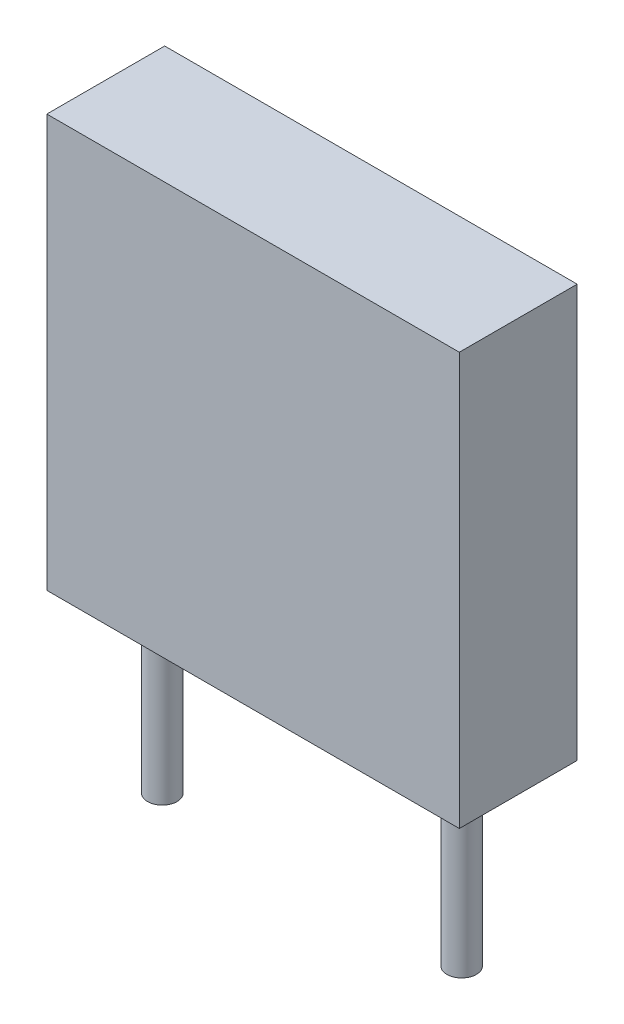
ISO-10303-21;
HEADER;
FILE_DESCRIPTION(('STEP AP214'),'2;1');
FILE_NAME('part.step','',(''),(''),'','','');
FILE_SCHEMA(('AUTOMOTIVE_DESIGN { 1 0 10303 214 1 1 1 1 }'));
ENDSEC;
DATA;
#1=APPLICATION_CONTEXT('core data for automotive mechanical design processes');
#2=APPLICATION_PROTOCOL_DEFINITION('international standard','automotive_design',2000,#1);
#3=PRODUCT_CONTEXT('',#1,'mechanical');
#4=PRODUCT('Part','Part','',(#3));
#5=PRODUCT_RELATED_PRODUCT_CATEGORY('part','',(#4));
#6=PRODUCT_DEFINITION_FORMATION('','',#4);
#7=PRODUCT_DEFINITION_CONTEXT('part definition',#1,'design');
#8=PRODUCT_DEFINITION('design','',#6,#7);
#9=PRODUCT_DEFINITION_SHAPE('','',#8);
#10=(LENGTH_UNIT() NAMED_UNIT(*) SI_UNIT(.MILLI.,.METRE.));
#11=(NAMED_UNIT(*) PLANE_ANGLE_UNIT() SI_UNIT($,.RADIAN.));
#12=(NAMED_UNIT(*) SI_UNIT($,.STERADIAN.) SOLID_ANGLE_UNIT());
#13=UNCERTAINTY_MEASURE_WITH_UNIT(LENGTH_MEASURE(1.E-05),#10,'distance_accuracy_value','');
#14=(GEOMETRIC_REPRESENTATION_CONTEXT(3) GLOBAL_UNCERTAINTY_ASSIGNED_CONTEXT((#13)) GLOBAL_UNIT_ASSIGNED_CONTEXT((#10,
#11,#12)) REPRESENTATION_CONTEXT('',''));
#15=CARTESIAN_POINT('',(0.,0.,0.));
#16=DIRECTION('',(0.,0.,1.));
#17=DIRECTION('',(1.,0.,0.));
#18=AXIS2_PLACEMENT_3D('',#15,#16,#17);
#19=CARTESIAN_POINT('',(0.,0.,-2.));
#20=DIRECTION('',(0.,-1.,0.));
#21=DIRECTION('',(0.,0.,-1.));
#22=AXIS2_PLACEMENT_3D('',#19,#20,#21);
#23=PLANE('',#22);
#24=CARTESIAN_POINT('',(0.96,0.,-1.));
#25=DIRECTION('',(0.,-1.,0.));
#26=DIRECTION('',(0.,0.,1.));
#27=AXIS2_PLACEMENT_3D('',#24,#25,#26);
#28=CIRCLE('',#27,0.25);
#29=CARTESIAN_POINT('',(0.96,0.,-0.75));
#30=VERTEX_POINT('',#29);
#31=EDGE_CURVE('E98',#30,#30,#28,.T.);
#32=ORIENTED_EDGE('',*,*,#31,.F.);
#33=EDGE_LOOP('',(#32));
#34=FACE_BOUND('',#33,.T.);
#35=DIRECTION('',(0.,0.,1.));
#36=VECTOR('',#35,1.);
#37=CARTESIAN_POINT('',(0.,0.,0.));
#38=LINE('',#37,#36);
#39=CARTESIAN_POINT('',(0.,0.,-2.));
#40=VERTEX_POINT('',#39);
#41=CARTESIAN_POINT('',(0.,0.,0.));
#42=VERTEX_POINT('',#41);
#43=EDGE_CURVE('E82',#40,#42,#38,.T.);
#44=ORIENTED_EDGE('',*,*,#43,.F.);
#45=DIRECTION('',(-1.,0.,0.));
#46=VECTOR('',#45,1.);
#47=CARTESIAN_POINT('',(0.,0.,-2.));
#48=LINE('',#47,#46);
#49=CARTESIAN_POINT('',(7.,0.,-2.));
#50=VERTEX_POINT('',#49);
#51=EDGE_CURVE('E103',#50,#40,#48,.T.);
#52=ORIENTED_EDGE('',*,*,#51,.F.);
#53=DIRECTION('',(0.,0.,-1.));
#54=VECTOR('',#53,1.);
#55=CARTESIAN_POINT('',(7.,0.,0.));
#56=LINE('',#55,#54);
#57=CARTESIAN_POINT('',(7.,0.,0.));
#58=VERTEX_POINT('',#57);
#59=EDGE_CURVE('E83',#58,#50,#56,.T.);
#60=ORIENTED_EDGE('',*,*,#59,.F.);
#61=DIRECTION('',(1.,0.,0.));
#62=VECTOR('',#61,1.);
#63=CARTESIAN_POINT('',(0.,0.,0.));
#64=LINE('',#63,#62);
#65=EDGE_CURVE('E78',#42,#58,#64,.T.);
#66=ORIENTED_EDGE('',*,*,#65,.F.);
#67=EDGE_LOOP('',(#44,#52,#60,#66));
#68=FACE_BOUND('',#67,.T.);
#69=CARTESIAN_POINT('',(6.04,0.,-1.));
#70=DIRECTION('',(0.,-1.,0.));
#71=DIRECTION('',(0.,0.,-1.));
#72=AXIS2_PLACEMENT_3D('',#69,#70,#71);
#73=CIRCLE('',#72,0.25);
#74=CARTESIAN_POINT('',(6.04,0.,-1.25));
#75=VERTEX_POINT('',#74);
#76=EDGE_CURVE('E152',#75,#75,#73,.T.);
#77=ORIENTED_EDGE('',*,*,#76,.F.);
#78=EDGE_LOOP('',(#77));
#79=FACE_BOUND('',#78,.T.);
#80=ADVANCED_FACE('F37',(#34,#68,#79),#23,.T.);
#81=CARTESIAN_POINT('',(0.,7.,0.));
#82=DIRECTION('',(1.,0.,0.));
#83=DIRECTION('',(0.,0.,-1.));
#84=AXIS2_PLACEMENT_3D('',#81,#82,#83);
#85=PLANE('',#84);
#86=ORIENTED_EDGE('',*,*,#43,.T.);
#87=DIRECTION('',(0.,-1.,0.));
#88=VECTOR('',#87,1.);
#89=CARTESIAN_POINT('',(0.,7.,0.));
#90=LINE('',#89,#88);
#91=CARTESIAN_POINT('',(0.,7.,0.));
#92=VERTEX_POINT('',#91);
#93=EDGE_CURVE('E11',#92,#42,#90,.T.);
#94=ORIENTED_EDGE('',*,*,#93,.F.);
#95=DIRECTION('',(0.,0.,1.));
#96=VECTOR('',#95,1.);
#97=CARTESIAN_POINT('',(0.,7.,0.));
#98=LINE('',#97,#96);
#99=CARTESIAN_POINT('',(0.,7.,-2.));
#100=VERTEX_POINT('',#99);
#101=EDGE_CURVE('E105',#100,#92,#98,.T.);
#102=ORIENTED_EDGE('',*,*,#101,.F.);
#103=DIRECTION('',(0.,-1.,0.));
#104=VECTOR('',#103,1.);
#105=CARTESIAN_POINT('',(0.,7.,-2.));
#106=LINE('',#105,#104);
#107=EDGE_CURVE('E94',#100,#40,#106,.T.);
#108=ORIENTED_EDGE('',*,*,#107,.T.);
#109=EDGE_LOOP('',(#86,#94,#102,#108));
#110=FACE_BOUND('',#109,.T.);
#111=ADVANCED_FACE('F39',(#110),#85,.F.);
#112=CARTESIAN_POINT('',(0.,7.,0.));
#113=DIRECTION('',(0.,0.,-1.));
#114=DIRECTION('',(-1.,0.,0.));
#115=AXIS2_PLACEMENT_3D('',#112,#113,#114);
#116=PLANE('',#115);
#117=ORIENTED_EDGE('',*,*,#65,.T.);
#118=DIRECTION('',(0.,-1.,0.));
#119=VECTOR('',#118,1.);
#120=CARTESIAN_POINT('',(7.,7.,0.));
#121=LINE('',#120,#119);
#122=CARTESIAN_POINT('',(7.,7.,0.));
#123=VERTEX_POINT('',#122);
#124=EDGE_CURVE('E45',#123,#58,#121,.T.);
#125=ORIENTED_EDGE('',*,*,#124,.F.);
#126=DIRECTION('',(1.,0.,0.));
#127=VECTOR('',#126,1.);
#128=CARTESIAN_POINT('',(0.,7.,0.));
#129=LINE('',#128,#127);
#130=EDGE_CURVE('E90',#92,#123,#129,.T.);
#131=ORIENTED_EDGE('',*,*,#130,.F.);
#132=ORIENTED_EDGE('',*,*,#93,.T.);
#133=EDGE_LOOP('',(#117,#125,#131,#132));
#134=FACE_BOUND('',#133,.T.);
#135=ADVANCED_FACE('F89',(#134),#116,.F.);
#136=CARTESIAN_POINT('',(7.,7.,0.));
#137=DIRECTION('',(-1.,0.,0.));
#138=DIRECTION('',(0.,0.,1.));
#139=AXIS2_PLACEMENT_3D('',#136,#137,#138);
#140=PLANE('',#139);
#141=ORIENTED_EDGE('',*,*,#59,.T.);
#142=DIRECTION('',(0.,-1.,0.));
#143=VECTOR('',#142,1.);
#144=CARTESIAN_POINT('',(7.,7.,-2.));
#145=LINE('',#144,#143);
#146=CARTESIAN_POINT('',(7.,7.,-2.));
#147=VERTEX_POINT('',#146);
#148=EDGE_CURVE('E111',#147,#50,#145,.T.);
#149=ORIENTED_EDGE('',*,*,#148,.F.);
#150=DIRECTION('',(0.,0.,-1.));
#151=VECTOR('',#150,1.);
#152=CARTESIAN_POINT('',(7.,7.,0.));
#153=LINE('',#152,#151);
#154=EDGE_CURVE('E57',#123,#147,#153,.T.);
#155=ORIENTED_EDGE('',*,*,#154,.F.);
#156=ORIENTED_EDGE('',*,*,#124,.T.);
#157=EDGE_LOOP('',(#141,#149,#155,#156));
#158=FACE_BOUND('',#157,.T.);
#159=ADVANCED_FACE('F114',(#158),#140,.F.);
#160=CARTESIAN_POINT('',(0.,7.,-2.));
#161=DIRECTION('',(0.,0.,1.));
#162=DIRECTION('',(1.,0.,0.));
#163=AXIS2_PLACEMENT_3D('',#160,#161,#162);
#164=PLANE('',#163);
#165=ORIENTED_EDGE('',*,*,#51,.T.);
#166=ORIENTED_EDGE('',*,*,#107,.F.);
#167=DIRECTION('',(-1.,0.,0.));
#168=VECTOR('',#167,1.);
#169=CARTESIAN_POINT('',(0.,7.,-2.));
#170=LINE('',#169,#168);
#171=EDGE_CURVE('E52',#147,#100,#170,.T.);
#172=ORIENTED_EDGE('',*,*,#171,.F.);
#173=ORIENTED_EDGE('',*,*,#148,.T.);
#174=EDGE_LOOP('',(#165,#166,#172,#173));
#175=FACE_BOUND('',#174,.T.);
#176=ADVANCED_FACE('F116',(#175),#164,.F.);
#177=CARTESIAN_POINT('',(0.,7.,-2.));
#178=DIRECTION('',(0.,-1.,0.));
#179=DIRECTION('',(0.,0.,-1.));
#180=AXIS2_PLACEMENT_3D('',#177,#178,#179);
#181=PLANE('',#180);
#182=ORIENTED_EDGE('',*,*,#101,.T.);
#183=ORIENTED_EDGE('',*,*,#130,.T.);
#184=ORIENTED_EDGE('',*,*,#154,.T.);
#185=ORIENTED_EDGE('',*,*,#171,.T.);
#186=EDGE_LOOP('',(#182,#183,#184,#185));
#187=FACE_BOUND('',#186,.T.);
#188=ADVANCED_FACE('F117',(#187),#181,.F.);
#189=CARTESIAN_POINT('',(0.96,-3.,-1.));
#190=DIRECTION('',(0.,1.,0.));
#191=DIRECTION('',(0.,0.,1.));
#192=AXIS2_PLACEMENT_3D('',#189,#190,#191);
#193=CYLINDRICAL_SURFACE('',#192,0.25);
#194=CARTESIAN_POINT('',(0.96,-3.,-1.));
#195=DIRECTION('',(0.,-1.,0.));
#196=DIRECTION('',(0.,0.,1.));
#197=AXIS2_PLACEMENT_3D('',#194,#195,#196);
#198=CIRCLE('',#197,0.25);
#199=CARTESIAN_POINT('',(0.96,-3.,-0.75));
#200=VERTEX_POINT('',#199);
#201=EDGE_CURVE('E95',#200,#200,#198,.T.);
#202=ORIENTED_EDGE('',*,*,#201,.F.);
#203=EDGE_LOOP('',(#202));
#204=FACE_BOUND('',#203,.T.);
#205=ORIENTED_EDGE('',*,*,#31,.T.);
#206=EDGE_LOOP('',(#205));
#207=FACE_BOUND('',#206,.T.);
#208=ADVANCED_FACE('F119',(#204,#207),#193,.T.);
#209=CARTESIAN_POINT('',(0.96,-3.,-1.));
#210=DIRECTION('',(0.,1.,0.));
#211=DIRECTION('',(0.,0.,1.));
#212=AXIS2_PLACEMENT_3D('',#209,#210,#211);
#213=PLANE('',#212);
#214=ORIENTED_EDGE('',*,*,#201,.T.);
#215=EDGE_LOOP('',(#214));
#216=FACE_BOUND('',#215,.T.);
#217=ADVANCED_FACE('F125',(#216),#213,.F.);
#218=CARTESIAN_POINT('',(6.04,-3.,-1.));
#219=DIRECTION('',(0.,1.,0.));
#220=DIRECTION('',(0.,0.,1.));
#221=AXIS2_PLACEMENT_3D('',#218,#219,#220);
#222=CYLINDRICAL_SURFACE('',#221,0.25);
#223=CARTESIAN_POINT('',(6.04,-3.,-1.));
#224=DIRECTION('',(0.,-1.,0.));
#225=DIRECTION('',(0.,0.,-1.));
#226=AXIS2_PLACEMENT_3D('',#223,#224,#225);
#227=CIRCLE('',#226,0.25);
#228=CARTESIAN_POINT('',(6.04,-3.,-1.25));
#229=VERTEX_POINT('',#228);
#230=EDGE_CURVE('E151',#229,#229,#227,.T.);
#231=ORIENTED_EDGE('',*,*,#230,.F.);
#232=EDGE_LOOP('',(#231));
#233=FACE_BOUND('',#232,.T.);
#234=ORIENTED_EDGE('',*,*,#76,.T.);
#235=EDGE_LOOP('',(#234));
#236=FACE_BOUND('',#235,.T.);
#237=ADVANCED_FACE('F139',(#233,#236),#222,.T.);
#238=CARTESIAN_POINT('',(6.04,-3.,-1.));
#239=DIRECTION('',(0.,-1.,0.));
#240=DIRECTION('',(0.,0.,-1.));
#241=AXIS2_PLACEMENT_3D('',#238,#239,#240);
#242=PLANE('',#241);
#243=ORIENTED_EDGE('',*,*,#230,.T.);
#244=EDGE_LOOP('',(#243));
#245=FACE_BOUND('',#244,.T.);
#246=ADVANCED_FACE('F143',(#245),#242,.T.);
#247=CLOSED_SHELL('',(#80,#111,#135,#159,#176,#188,#208,#217,#237,#246));
#248=MANIFOLD_SOLID_BREP('B2',#247);
#249=ADVANCED_BREP_SHAPE_REPRESENTATION('',(#18,#248),#14);
#250=SHAPE_DEFINITION_REPRESENTATION(#9,#249);
ENDSEC;
END-ISO-10303-21;
